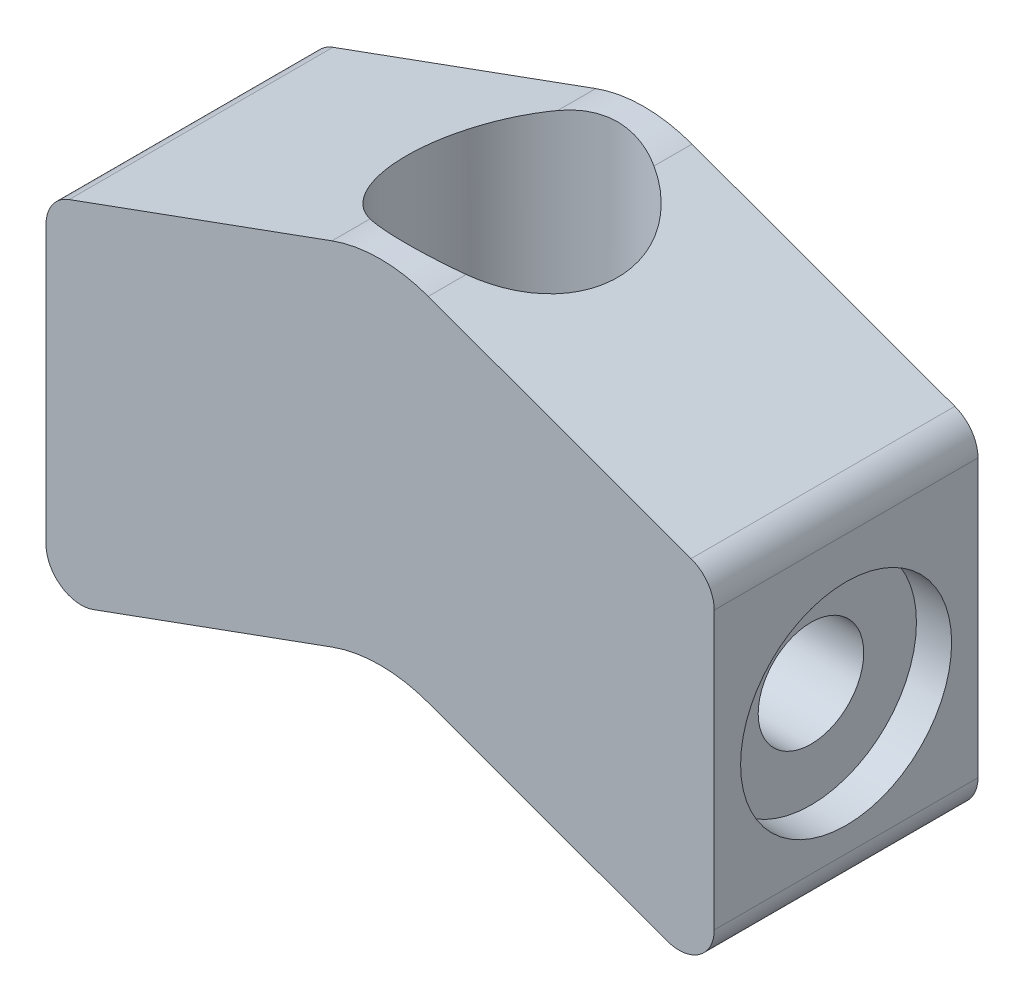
from build123d import *

# Parameters (mm, degrees)
EXTRUDE_1_DEPTH          = 7.5
CUT_EXTRUDE_1_DEPTH      = 35.529203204
CUT_EXTRUDE_1_DEPTH_BACK = 35.529203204
SKETCH_2_R               = 6
SKETCH_3_R               = 6
CUT_EXTRUDE_2_DEPTH      = 2
SKETCH_4_R               = 3
CUT_EXTRUDE_3_DEPTH      = 47.122292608


with BuildPart() as part:
    # Sketch 1 → Extrude 1 (new, symmetric)
    with BuildSketch(Plane.XY):
        with BuildLine():
            Line((-2.736161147, -2.76930757), (-17.684040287, -8.209890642))
            ThreePointArc((-17.684040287, -8.209890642), (-18.638304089, -8.942123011), (-19, -10.089275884))
            Line((-19, -10.089275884), (-19, -25.839106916))
            ThreePointArc((-19, -25.839106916), (-18.147152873, -27.477411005), (-16.315959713, -27.718492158))
            Line((-16.315959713, -27.718492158), (-2.736161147, -22.775849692))
            ThreePointArc((-2.736161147, -22.775849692), (0, -22.293390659), (2.736161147, -22.775849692))
            Line((2.736161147, -22.775849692), (16.315959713, -27.718492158))
            ThreePointArc((16.315959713, -27.718492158), (18.147152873, -27.477411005), (19, -25.839106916))
            Line((19, -25.839106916), (19, -10.089275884))
            ThreePointArc((19, -10.089275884), (18.638304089, -8.942123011), (17.684040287, -8.209890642))
            Line((17.684040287, -8.209890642), (2.736161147, -2.76930757))
            ThreePointArc((2.736161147, -2.76930757), (0, -2.286848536), (-2.736161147, -2.76930757))
        make_face()
    extrude(amount=EXTRUDE_1_DEPTH, both=True)

    # Sketch 2 → Cut-Extrude 1 (cut, two sides: drawn at the far end of the back side and taken through both)
    with BuildSketch(Plane(origin=(0, 0, 0), x_dir=(1, 0, 0), z_dir=(0, 1, 0)).offset(-CUT_EXTRUDE_1_DEPTH_BACK)):
        with Locations(Location((0, 0, 0), (0, 0, 242.868976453))):
            Circle(SKETCH_2_R)
    extrude(amount=CUT_EXTRUDE_1_DEPTH + CUT_EXTRUDE_1_DEPTH_BACK, mode=Mode.SUBTRACT)

    # Sketch 3 → Cut-Extrude 2 (cut)
    with BuildSketch(Plane.ZY.offset(19)):
        with Locations(Location((0, -18.44065519, 0), (0, 0, 270))):
            Circle(SKETCH_3_R)
    cut_extrude_2 = extrude(amount=-CUT_EXTRUDE_2_DEPTH, mode=Mode.SUBTRACT)

    # Sketch 4 → Cut-Extrude 3 (cut, through all)
    with BuildSketch(Plane.ZY.offset(17)):
        with Locations(Location((0, -18.44065519, 0), (0, 0, 270))):
            Circle(SKETCH_4_R)
    cut_extrude_3 = extrude(amount=-CUT_EXTRUDE_3_DEPTH, mode=Mode.SUBTRACT)

    # Mirror 1: Cut-Extrude 2, Cut-Extrude 3 across plane
    add(cut_extrude_2.mirror(Plane(origin=(0, 0, 0), x_dir=(0, 0, 1), z_dir=(1, 0, 0))), mode=Mode.SUBTRACT)
    add(cut_extrude_3.mirror(Plane(origin=(0, 0, 0), x_dir=(0, 0, 1), z_dir=(1, 0, 0))), mode=Mode.SUBTRACT)


solid = part.part
